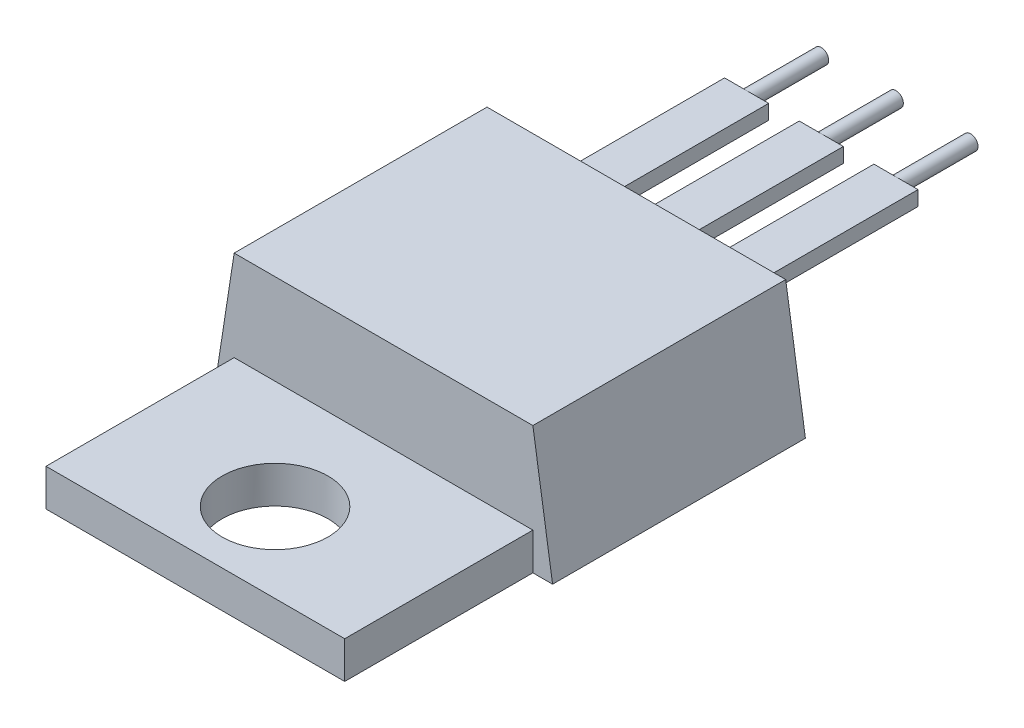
from build123d import *

# Parameters (mm, degrees)
EXTRUDE_1_DEPTH      = 8.6
EXTRUDE_2_DEPTH      = 6.4
EXTRUDE_2_DEPTH_BACK = 7.6
SKETCH_2_W           = 10.16
SKETCH_2_H           = 1.26
SKETCH_3_R           = 1.8
CUT_EXTRUDE_1_DEPTH  = 1.26
SKETCH_4_W           = 1.5
SKETCH_4_H           = 0.5
EXTRUDE_3_DEPTH      = 6.29
EXTRUDE_3_2_DEPTH    = 6.29
EXTRUDE_3_3_DEPTH    = 6.29
SKETCH_5_R           = 0.25
EXTRUDE_4_DEPTH      = 2.54


with BuildPart() as part:
    # Sketch 1 → Extrude 1 (new body)
    with BuildSketch(Plane.XY):
        Polygon((-5.75, -2.7), (5.75, -2.7), (5.08, 1.64), (-5.08, 1.64), align=None)
    extrude(amount=EXTRUDE_1_DEPTH)


with BuildPart() as body_2:
    # Sketch 2 → Extrude 2 (new, two sides: drawn at the far end of the back side and taken through both)
    with BuildSketch(Plane.XY.offset(8.6).offset(-EXTRUDE_2_DEPTH_BACK)):
        with Locations((0, -2.07)):
            Rectangle(SKETCH_2_W, SKETCH_2_H)
    extrude(amount=EXTRUDE_2_DEPTH + EXTRUDE_2_DEPTH_BACK)

    # Sketch 3 → Cut-Extrude 1 (cut)
    with BuildSketch(Plane(origin=(0, -1.44, 0), x_dir=(1, 0, 0), z_dir=(0, 1, 0))):
        with Locations(Location((0, -12.29, 0), (0, 0, 270))):
            Circle(SKETCH_3_R)
    extrude(amount=-CUT_EXTRUDE_1_DEPTH, mode=Mode.SUBTRACT)


with BuildPart() as body_3:
    # Sketch 4 → Extrude 3 (new body)
    with BuildSketch(Plane(origin=(0, 0, 0), x_dir=(-1, 0, 0), z_dir=(0, 0, -1))):
        Rectangle(SKETCH_4_W, SKETCH_4_H)
    extrude(amount=EXTRUDE_3_DEPTH)



with BuildPart() as body_4:
    # Sketch 4 → Extrude 3 2 (new body)
    with BuildSketch(Plane(origin=(0, 0, 0), x_dir=(-1, 0, 0), z_dir=(0, 0, -1))):
        with Locations((-2.54, 0)):
            Rectangle(SKETCH_4_W, SKETCH_4_H)
    extrude(amount=EXTRUDE_3_2_DEPTH)


with BuildPart() as body_5:
    # Sketch 4 → Extrude 3 3 (new body)
    with BuildSketch(Plane(origin=(0, 0, 0), x_dir=(-1, 0, 0), z_dir=(0, 0, -1))):
        with Locations((2.54, 0)):
            Rectangle(SKETCH_4_W, SKETCH_4_H)
    extrude(amount=EXTRUDE_3_3_DEPTH)


with BuildPart() as body_3_1:
    add(body_3.part)

    add(body_4.part)  # Extrude 4 merges body 4

    add(body_5.part)  # Extrude 4 merges body 5
    # Sketch 5 → Extrude 4 (add)
    with BuildSketch(Plane(origin=(0, 0, -6.29), x_dir=(-1, 0, 0), z_dir=(0, 0, -1))):
        with Locations(Location((0, 0, 0), (0, 0, 270))):
            Circle(SKETCH_5_R)
        with Locations(Location((-2.54, 0, 0), (0, 0, 270))):
            Circle(SKETCH_5_R)
        with Locations(Location((2.54, 0, 0), (0, 0, 270))):
            Circle(SKETCH_5_R)
    extrude(amount=EXTRUDE_4_DEPTH)


solid = Compound([part.part, body_2.part, body_3_1.part])
